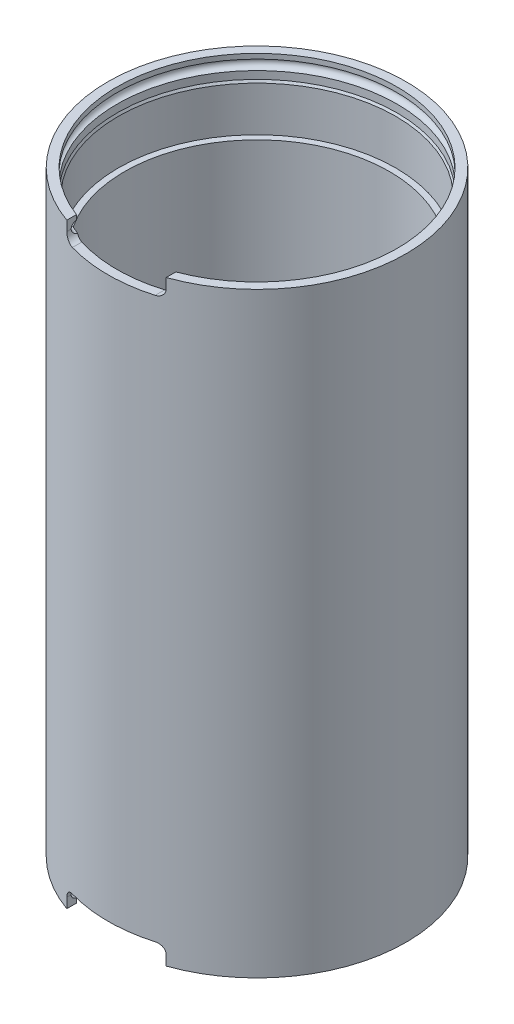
from build123d import *

# Parameters (mm, degrees)
SKETCH1_R           = 57.15
SKETCH1_R_2         = 50.8
BOSS_EXTRUDE1_DEPTH = 114.3
CUT_EXTRUDE1_DEPTH  = 140.9883388


with BuildPart() as part:
    # Sketch1 → Boss-Extrude1 (new, symmetric)
    with BuildSketch(Plane(origin=(0, 0, 0), x_dir=(1, 0, 0), z_dir=(0, 1, 0))):
        with Locations(Location((0, 0, 0), (0, 0, 270))):
            Circle(SKETCH1_R)
        with Locations(Location((0, 0, 0), (0, 0, 270))):
            Circle(SKETCH1_R_2, mode=Mode.SUBTRACT)
    extrude(amount=BOSS_EXTRUDE1_DEPTH, both=True)

    # Sketch3 → Cut-Revolve1 (revolve, cut)
    with BuildSketch(Plane.XY, mode=Mode.PRIVATE) as cut_revolve1_sk:
        with BuildLine():
            Line((-50.8, 114.3), (-53.6829, 114.3))
            Line((-53.6829, 114.3), (-53.6829, 112.395))
            ThreePointArc((-53.6829, 112.395), (-55.5879, 110.49), (-53.6829, 108.585))
            Line((-53.6829, 108.585), (-53.6829, 105.65488181))
            Line((-53.6829, 105.65488181), (-53.1749, 104.775))
            Line((-53.1749, 104.775), (-53.1749, 87.63))
            Line((-53.1749, 87.63), (-50.8, 87.63))
            Line((-50.8, 87.63), (-50.8, 114.3))
        make_face()
    cut_revolve1 = revolve(cut_revolve1_sk.sketch.rotate(Axis((0, -114.3, 0), (0, 1, 0)), 270), axis=Axis((0, -114.3, 0), (0, 1, 0)), mode=Mode.SUBTRACT)

    # Sketch4 → Cut-Extrude1 (cut, through all)
    with BuildSketch(Plane.XY):
        with BuildLine():
            Line((-19.05, 114.3), (19.05, 114.3))
            Line((19.05, 114.3), (19.05, 110.49))
            ThreePointArc((19.05, 110.49), (18.12006403, 108.24493597), (15.875, 107.315))
            Line((15.875, 107.315), (-15.875, 107.315))
            ThreePointArc((-15.875, 107.315), (-18.12006403, 108.24493597), (-19.05, 110.49))
            Line((-19.05, 110.49), (-19.05, 114.3))
        make_face()
    cut_extrude1 = extrude(amount=CUT_EXTRUDE1_DEPTH, mode=Mode.SUBTRACT)

    # Mirror1: Cut-Revolve1, Cut-Extrude1 across plane
    add(cut_revolve1.mirror(Plane.ZX), mode=Mode.SUBTRACT)
    add(cut_extrude1.mirror(Plane.ZX), mode=Mode.SUBTRACT)


solid = part.part
